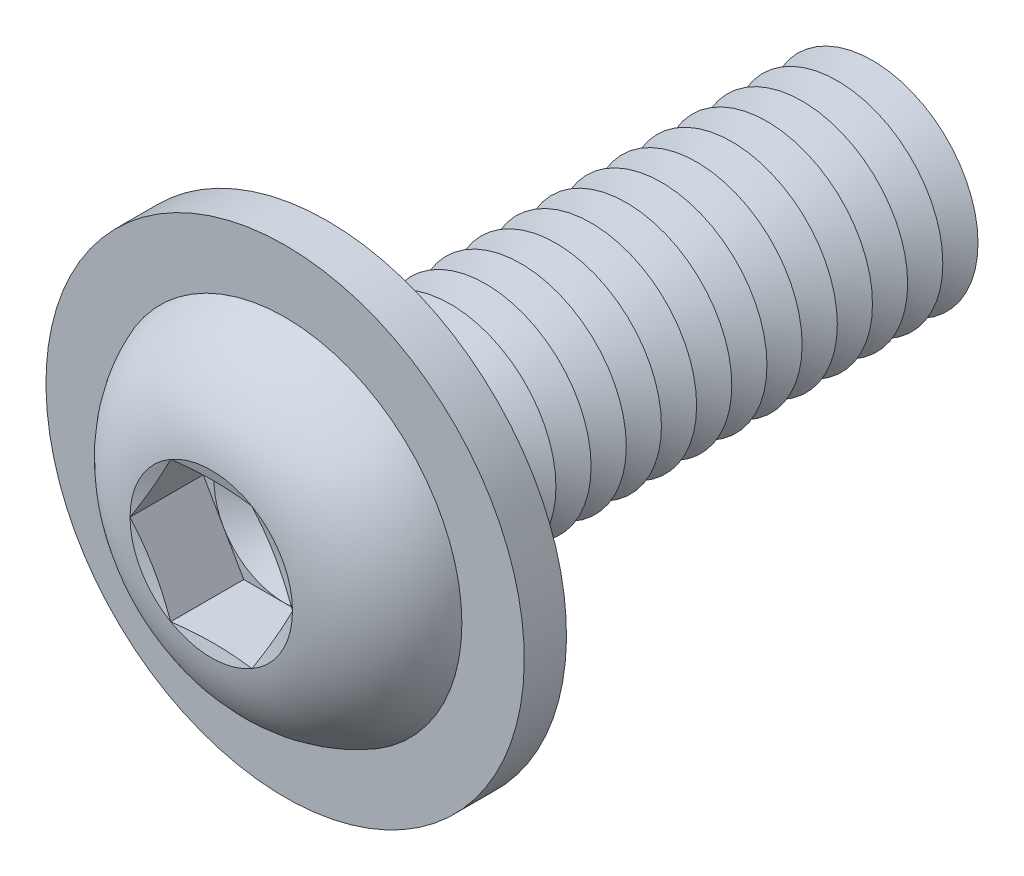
from build123d import *

# Parameters (mm, degrees)
FILLET1_R           = 0.5
LPATTERN1_COUNT     = 16
LPATTERN1_PITCH     = 1
CUT_EXTRUDE1_DEPTH  = 2.08
SKETCH5_R           = 6.8
SKETCH5_R_2         = 3.5
BOSS_EXTRUDE1_DEPTH = 1.2


with BuildPart() as part:
    # Sketch1 → Revolve1 (revolve)
    with BuildSketch(Plane(origin=(0, 0, 0), x_dir=(0, 0, -1), z_dir=(1, 0, 0)), mode=Mode.PRIVATE) as revolve1_sk:
        with BuildLine():
            Line((0, 3), (0, 5.25))
            ThreePointArc((0, 5.25), (-2.210041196, 4.408189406), (-3.3, 2.3094))
            Line((-3.3, 2.3094), (-2.990599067, 1.1547))
            Line((-2.990599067, 1.1547), (-3.3, 1.1547))
            Line((-3.3, 1.1547), (-3.3, 0))
            Line((-3.3, 0), (16, 0))
            Line((16, 0), (16, 3))
            Line((16, 3), (0, 3))
        make_face()
    revolve(revolve1_sk.sketch.rotate(Axis((0, 0, -16), (0, 0, 1)), 90), axis=Axis((0, 0, -16), (0, 0, 1)))

    # Fillet1
    fillet1_edges = [part.edges().sort_by_distance(p)[0] for p in [
        (3, 0, 0),
    ]]
    fillet(fillet1_edges, radius=FILLET1_R)

    # Sketch2 → Cut-Revolve1 (revolve, cut)
    with BuildSketch(Plane(origin=(0, 0, 0), x_dir=(0, 0, -1), z_dir=(1, 0, 0)), mode=Mode.PRIVATE) as cut_revolve1_sk:
        Polygon((15.5, 3), (16.5, 3), (16, 2.133974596), align=None)
    cut_revolve1 = revolve(cut_revolve1_sk.sketch.rotate(Axis((0, 0, -16), (0, 0, -1)), 270), axis=Axis((0, 0, -16), (0, 0, -1)), mode=Mode.SUBTRACT)

    # LPattern1: Cut-Revolve1 ×16
    with Locations(*[(0, 0, i * LPATTERN1_PITCH) for i in range(1, LPATTERN1_COUNT)]):
        add(cut_revolve1, mode=Mode.SUBTRACT)

    # Sketch3 → Cut-Extrude1 (cut)
    with BuildSketch(Plane.XY.offset(3.3)):
        Polygon((1.1547, 1.999999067), (-1.1547, 1.999999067), (-2.3094, 0), (-1.1547, -1.999999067), (1.1547, -1.999999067), (2.3094, 0), align=None)
    extrude(amount=-CUT_EXTRUDE1_DEPTH, mode=Mode.SUBTRACT)

    # Cut-Extrude2 cone 1 section (on through the dimple's axis) → Cut-Extrude2 (revolve, cut)
    with BuildSketch(Plane(origin=(0, 0, 1.22), x_dir=(0, -1, 0), z_dir=(1, 0, 0))):
        Polygon((0, 0), (1.999999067, 0), (0, 1.1547), align=None)
    revolve(axis=Axis((0, 0, 1.22), (0, 0, -1)), mode=Mode.SUBTRACT)

    # Sketch5 → Boss-Extrude1 (add)
    with BuildSketch(Plane(origin=(0, 0, 0), x_dir=(-1, 0, 0), z_dir=(0, 0, -1))):
        with Locations(Location((0, 0, 0), (0, 0, 90))):
            Circle(SKETCH5_R)
        Circle(SKETCH5_R_2, mode=Mode.SUBTRACT)
    extrude(amount=-BOSS_EXTRUDE1_DEPTH)


solid = part.part
